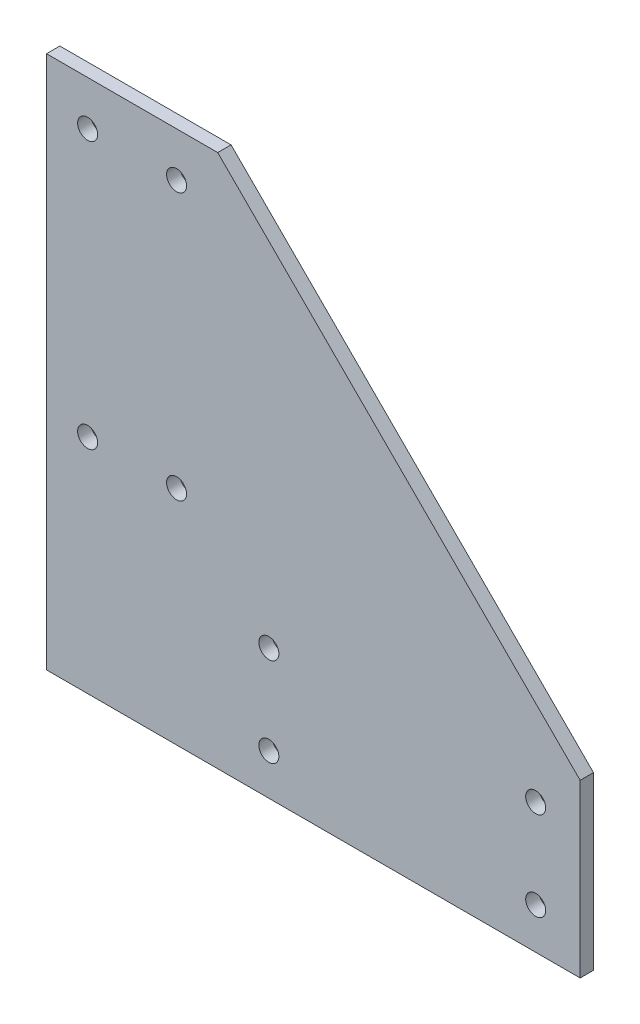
ISO-10303-21;
HEADER;
FILE_DESCRIPTION(('STEP AP214'),'2;1');
FILE_NAME('part.step','',(''),(''),'','','');
FILE_SCHEMA(('AUTOMOTIVE_DESIGN { 1 0 10303 214 1 1 1 1 }'));
ENDSEC;
DATA;
#1=APPLICATION_CONTEXT('core data for automotive mechanical design processes');
#2=APPLICATION_PROTOCOL_DEFINITION('international standard','automotive_design',2000,#1);
#3=PRODUCT_CONTEXT('',#1,'mechanical');
#4=PRODUCT('Part','Part','',(#3));
#5=PRODUCT_RELATED_PRODUCT_CATEGORY('part','',(#4));
#6=PRODUCT_DEFINITION_FORMATION('','',#4);
#7=PRODUCT_DEFINITION_CONTEXT('part definition',#1,'design');
#8=PRODUCT_DEFINITION('design','',#6,#7);
#9=PRODUCT_DEFINITION_SHAPE('','',#8);
#10=(LENGTH_UNIT() NAMED_UNIT(*) SI_UNIT(.MILLI.,.METRE.));
#11=(NAMED_UNIT(*) PLANE_ANGLE_UNIT() SI_UNIT($,.RADIAN.));
#12=(NAMED_UNIT(*) SI_UNIT($,.STERADIAN.) SOLID_ANGLE_UNIT());
#13=UNCERTAINTY_MEASURE_WITH_UNIT(LENGTH_MEASURE(1.E-05),#10,'distance_accuracy_value','');
#14=(GEOMETRIC_REPRESENTATION_CONTEXT(3) GLOBAL_UNCERTAINTY_ASSIGNED_CONTEXT((#13)) GLOBAL_UNIT_ASSIGNED_CONTEXT((#10,
#11,#12)) REPRESENTATION_CONTEXT('',''));
#15=CARTESIAN_POINT('',(0.,0.,0.));
#16=DIRECTION('',(0.,0.,1.));
#17=DIRECTION('',(1.,0.,0.));
#18=AXIS2_PLACEMENT_3D('',#15,#16,#17);
#19=CARTESIAN_POINT('',(-120.,120.,6.));
#20=DIRECTION('',(1.,0.,0.));
#21=DIRECTION('',(0.,0.,-1.));
#22=AXIS2_PLACEMENT_3D('',#19,#20,#21);
#23=PLANE('',#22);
#24=DIRECTION('',(0.,-1.,0.));
#25=VECTOR('',#24,1.);
#26=CARTESIAN_POINT('',(-120.,120.,0.));
#27=LINE('',#26,#25);
#28=CARTESIAN_POINT('',(-120.,120.,0.));
#29=VERTEX_POINT('',#28);
#30=CARTESIAN_POINT('',(-120.,-120.,0.));
#31=VERTEX_POINT('',#30);
#32=EDGE_CURVE('E107',#29,#31,#27,.T.);
#33=ORIENTED_EDGE('',*,*,#32,.T.);
#34=DIRECTION('',(0.,0.,-1.));
#35=VECTOR('',#34,1.);
#36=CARTESIAN_POINT('',(-120.,-120.,6.));
#37=LINE('',#36,#35);
#38=CARTESIAN_POINT('',(-120.,-120.,6.));
#39=VERTEX_POINT('',#38);
#40=EDGE_CURVE('E11',#39,#31,#37,.T.);
#41=ORIENTED_EDGE('',*,*,#40,.F.);
#42=DIRECTION('',(0.,-1.,0.));
#43=VECTOR('',#42,1.);
#44=CARTESIAN_POINT('',(-120.,120.,6.));
#45=LINE('',#44,#43);
#46=CARTESIAN_POINT('',(-120.,120.,6.));
#47=VERTEX_POINT('',#46);
#48=EDGE_CURVE('E116',#47,#39,#45,.T.);
#49=ORIENTED_EDGE('',*,*,#48,.F.);
#50=DIRECTION('',(0.,0.,-1.));
#51=VECTOR('',#50,1.);
#52=CARTESIAN_POINT('',(-120.,120.,6.));
#53=LINE('',#52,#51);
#54=EDGE_CURVE('E103',#47,#29,#53,.T.);
#55=ORIENTED_EDGE('',*,*,#54,.T.);
#56=EDGE_LOOP('',(#33,#41,#49,#55));
#57=FACE_BOUND('',#56,.T.);
#58=ADVANCED_FACE('F31',(#57),#23,.F.);
#59=CARTESIAN_POINT('',(-120.,-120.,6.));
#60=DIRECTION('',(0.,1.,0.));
#61=DIRECTION('',(0.,0.,1.));
#62=AXIS2_PLACEMENT_3D('',#59,#60,#61);
#63=PLANE('',#62);
#64=DIRECTION('',(1.,0.,0.));
#65=VECTOR('',#64,1.);
#66=CARTESIAN_POINT('',(-120.,-120.,0.));
#67=LINE('',#66,#65);
#68=CARTESIAN_POINT('',(120.,-120.,0.));
#69=VERTEX_POINT('',#68);
#70=EDGE_CURVE('E110',#31,#69,#67,.T.);
#71=ORIENTED_EDGE('',*,*,#70,.T.);
#72=DIRECTION('',(0.,0.,-1.));
#73=VECTOR('',#72,1.);
#74=CARTESIAN_POINT('',(120.,-120.,6.));
#75=LINE('',#74,#73);
#76=CARTESIAN_POINT('',(120.,-120.,6.));
#77=VERTEX_POINT('',#76);
#78=EDGE_CURVE('E40',#77,#69,#75,.T.);
#79=ORIENTED_EDGE('',*,*,#78,.F.);
#80=DIRECTION('',(1.,0.,0.));
#81=VECTOR('',#80,1.);
#82=CARTESIAN_POINT('',(-120.,-120.,6.));
#83=LINE('',#82,#81);
#84=EDGE_CURVE('E83',#39,#77,#83,.T.);
#85=ORIENTED_EDGE('',*,*,#84,.F.);
#86=ORIENTED_EDGE('',*,*,#40,.T.);
#87=EDGE_LOOP('',(#71,#79,#85,#86));
#88=FACE_BOUND('',#87,.T.);
#89=ADVANCED_FACE('F171',(#88),#63,.F.);
#90=CARTESIAN_POINT('',(120.,-43.,6.));
#91=DIRECTION('',(-1.,0.,0.));
#92=DIRECTION('',(0.,-1.,0.));
#93=AXIS2_PLACEMENT_3D('',#90,#91,#92);
#94=PLANE('',#93);
#95=DIRECTION('',(0.,1.,0.));
#96=VECTOR('',#95,1.);
#97=CARTESIAN_POINT('',(120.,-43.,0.));
#98=LINE('',#97,#96);
#99=CARTESIAN_POINT('',(120.,-43.,0.));
#100=VERTEX_POINT('',#99);
#101=EDGE_CURVE('E98',#69,#100,#98,.T.);
#102=ORIENTED_EDGE('',*,*,#101,.T.);
#103=DIRECTION('',(0.,0.,-1.));
#104=VECTOR('',#103,1.);
#105=CARTESIAN_POINT('',(120.,-43.,6.));
#106=LINE('',#105,#104);
#107=CARTESIAN_POINT('',(120.,-43.,6.));
#108=VERTEX_POINT('',#107);
#109=EDGE_CURVE('E95',#108,#100,#106,.T.);
#110=ORIENTED_EDGE('',*,*,#109,.F.);
#111=DIRECTION('',(0.,1.,0.));
#112=VECTOR('',#111,1.);
#113=CARTESIAN_POINT('',(120.,-43.,6.));
#114=LINE('',#113,#112);
#115=EDGE_CURVE('E87',#77,#108,#114,.T.);
#116=ORIENTED_EDGE('',*,*,#115,.F.);
#117=ORIENTED_EDGE('',*,*,#78,.T.);
#118=EDGE_LOOP('',(#102,#110,#116,#117));
#119=FACE_BOUND('',#118,.T.);
#120=ADVANCED_FACE('F96',(#119),#94,.F.);
#121=CARTESIAN_POINT('',(-43.,120.,6.));
#122=DIRECTION('',(-0.707106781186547,-0.707106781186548,0.));
#123=DIRECTION('',(0.707106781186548,-0.707106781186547,0.));
#124=AXIS2_PLACEMENT_3D('',#121,#122,#123);
#125=PLANE('',#124);
#126=DIRECTION('',(-0.707106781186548,0.707106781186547,0.));
#127=VECTOR('',#126,1.);
#128=CARTESIAN_POINT('',(-43.,120.,0.));
#129=LINE('',#128,#127);
#130=CARTESIAN_POINT('',(-43.,120.,0.));
#131=VERTEX_POINT('',#130);
#132=EDGE_CURVE('E69',#100,#131,#129,.T.);
#133=ORIENTED_EDGE('',*,*,#132,.T.);
#134=DIRECTION('',(0.,0.,-1.));
#135=VECTOR('',#134,1.);
#136=CARTESIAN_POINT('',(-43.,120.,6.));
#137=LINE('',#136,#135);
#138=CARTESIAN_POINT('',(-43.,120.,6.));
#139=VERTEX_POINT('',#138);
#140=EDGE_CURVE('E99',#139,#131,#137,.T.);
#141=ORIENTED_EDGE('',*,*,#140,.F.);
#142=DIRECTION('',(-0.707106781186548,0.707106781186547,0.));
#143=VECTOR('',#142,1.);
#144=CARTESIAN_POINT('',(-43.,120.,6.));
#145=LINE('',#144,#143);
#146=EDGE_CURVE('E91',#108,#139,#145,.T.);
#147=ORIENTED_EDGE('',*,*,#146,.F.);
#148=ORIENTED_EDGE('',*,*,#109,.T.);
#149=EDGE_LOOP('',(#133,#141,#147,#148));
#150=FACE_BOUND('',#149,.T.);
#151=ADVANCED_FACE('F101',(#150),#125,.F.);
#152=CARTESIAN_POINT('',(-120.,120.,6.));
#153=DIRECTION('',(0.,-1.,0.));
#154=DIRECTION('',(0.,0.,-1.));
#155=AXIS2_PLACEMENT_3D('',#152,#153,#154);
#156=PLANE('',#155);
#157=DIRECTION('',(-1.,0.,0.));
#158=VECTOR('',#157,1.);
#159=CARTESIAN_POINT('',(-120.,120.,0.));
#160=LINE('',#159,#158);
#161=EDGE_CURVE('E75',#131,#29,#160,.T.);
#162=ORIENTED_EDGE('',*,*,#161,.T.);
#163=ORIENTED_EDGE('',*,*,#54,.F.);
#164=DIRECTION('',(-1.,0.,0.));
#165=VECTOR('',#164,1.);
#166=CARTESIAN_POINT('',(-120.,120.,6.));
#167=LINE('',#166,#165);
#168=EDGE_CURVE('E49',#139,#47,#167,.T.);
#169=ORIENTED_EDGE('',*,*,#168,.F.);
#170=ORIENTED_EDGE('',*,*,#140,.T.);
#171=EDGE_LOOP('',(#162,#163,#169,#170));
#172=FACE_BOUND('',#171,.T.);
#173=ADVANCED_FACE('F185',(#172),#156,.F.);
#174=CARTESIAN_POINT('',(-120.,-120.,6.));
#175=DIRECTION('',(0.,0.,1.));
#176=DIRECTION('',(1.,0.,0.));
#177=AXIS2_PLACEMENT_3D('',#174,#175,#176);
#178=PLANE('',#177);
#179=CARTESIAN_POINT('',(-20.,-101.5,6.));
#180=DIRECTION('',(0.,0.,1.));
#181=DIRECTION('',(1.,0.,0.));
#182=AXIS2_PLACEMENT_3D('',#179,#180,#181);
#183=CIRCLE('',#182,4.49999999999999);
#184=CARTESIAN_POINT('',(-15.5,-101.5,6.));
#185=VERTEX_POINT('',#184);
#186=EDGE_CURVE('E154',#185,#185,#183,.T.);
#187=ORIENTED_EDGE('',*,*,#186,.F.);
#188=EDGE_LOOP('',(#187));
#189=FACE_BOUND('',#188,.T.);
#190=CARTESIAN_POINT('',(-20.,-61.5,6.));
#191=DIRECTION('',(0.,0.,1.));
#192=DIRECTION('',(1.,0.,0.));
#193=AXIS2_PLACEMENT_3D('',#190,#191,#192);
#194=CIRCLE('',#193,4.49999999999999);
#195=CARTESIAN_POINT('',(-15.5,-61.5,6.));
#196=VERTEX_POINT('',#195);
#197=EDGE_CURVE('E144',#196,#196,#194,.T.);
#198=ORIENTED_EDGE('',*,*,#197,.F.);
#199=EDGE_LOOP('',(#198));
#200=FACE_BOUND('',#199,.T.);
#201=CARTESIAN_POINT('',(100.,-101.5,6.));
#202=DIRECTION('',(0.,0.,1.));
#203=DIRECTION('',(1.,0.,0.));
#204=AXIS2_PLACEMENT_3D('',#201,#202,#203);
#205=CIRCLE('',#204,4.49999999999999);
#206=CARTESIAN_POINT('',(104.5,-101.5,6.));
#207=VERTEX_POINT('',#206);
#208=EDGE_CURVE('E141',#207,#207,#205,.T.);
#209=ORIENTED_EDGE('',*,*,#208,.F.);
#210=EDGE_LOOP('',(#209));
#211=FACE_BOUND('',#210,.T.);
#212=CARTESIAN_POINT('',(100.,-61.5,6.));
#213=DIRECTION('',(0.,0.,1.));
#214=DIRECTION('',(1.,0.,0.));
#215=AXIS2_PLACEMENT_3D('',#212,#213,#214);
#216=CIRCLE('',#215,4.49999999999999);
#217=CARTESIAN_POINT('',(104.5,-61.5,6.));
#218=VERTEX_POINT('',#217);
#219=EDGE_CURVE('E138',#218,#218,#216,.T.);
#220=ORIENTED_EDGE('',*,*,#219,.F.);
#221=EDGE_LOOP('',(#220));
#222=FACE_BOUND('',#221,.T.);
#223=CARTESIAN_POINT('',(-101.5,-20.,6.));
#224=DIRECTION('',(0.,0.,1.));
#225=DIRECTION('',(1.,0.,0.));
#226=AXIS2_PLACEMENT_3D('',#223,#224,#225);
#227=CIRCLE('',#226,4.49999999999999);
#228=CARTESIAN_POINT('',(-97.,-20.,6.));
#229=VERTEX_POINT('',#228);
#230=EDGE_CURVE('E134',#229,#229,#227,.T.);
#231=ORIENTED_EDGE('',*,*,#230,.F.);
#232=EDGE_LOOP('',(#231));
#233=FACE_BOUND('',#232,.T.);
#234=CARTESIAN_POINT('',(-61.5,-20.,6.));
#235=DIRECTION('',(0.,0.,1.));
#236=DIRECTION('',(1.,0.,0.));
#237=AXIS2_PLACEMENT_3D('',#234,#235,#236);
#238=CIRCLE('',#237,4.49999999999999);
#239=CARTESIAN_POINT('',(-57.,-20.,6.));
#240=VERTEX_POINT('',#239);
#241=EDGE_CURVE('E130',#240,#240,#238,.T.);
#242=ORIENTED_EDGE('',*,*,#241,.F.);
#243=EDGE_LOOP('',(#242));
#244=FACE_BOUND('',#243,.T.);
#245=CARTESIAN_POINT('',(-101.5,100.,6.));
#246=DIRECTION('',(0.,0.,1.));
#247=DIRECTION('',(1.,0.,0.));
#248=AXIS2_PLACEMENT_3D('',#245,#246,#247);
#249=CIRCLE('',#248,4.49999999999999);
#250=CARTESIAN_POINT('',(-97.,100.,6.));
#251=VERTEX_POINT('',#250);
#252=EDGE_CURVE('E126',#251,#251,#249,.T.);
#253=ORIENTED_EDGE('',*,*,#252,.F.);
#254=EDGE_LOOP('',(#253));
#255=FACE_BOUND('',#254,.T.);
#256=CARTESIAN_POINT('',(-61.5,100.,6.));
#257=DIRECTION('',(0.,0.,1.));
#258=DIRECTION('',(1.,0.,0.));
#259=AXIS2_PLACEMENT_3D('',#256,#257,#258);
#260=CIRCLE('',#259,4.49999999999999);
#261=CARTESIAN_POINT('',(-57.,100.,6.));
#262=VERTEX_POINT('',#261);
#263=EDGE_CURVE('E122',#262,#262,#260,.T.);
#264=ORIENTED_EDGE('',*,*,#263,.F.);
#265=EDGE_LOOP('',(#264));
#266=FACE_BOUND('',#265,.T.);
#267=ORIENTED_EDGE('',*,*,#48,.T.);
#268=ORIENTED_EDGE('',*,*,#84,.T.);
#269=ORIENTED_EDGE('',*,*,#115,.T.);
#270=ORIENTED_EDGE('',*,*,#146,.T.);
#271=ORIENTED_EDGE('',*,*,#168,.T.);
#272=EDGE_LOOP('',(#267,#268,#269,#270,#271));
#273=FACE_BOUND('',#272,.T.);
#274=ADVANCED_FACE('F89',(#189,#200,#211,#222,#233,#244,#255,#266,#273),#178,.T.);
#275=CARTESIAN_POINT('',(-120.,-120.,0.));
#276=DIRECTION('',(0.,0.,1.));
#277=DIRECTION('',(1.,0.,0.));
#278=AXIS2_PLACEMENT_3D('',#275,#276,#277);
#279=PLANE('',#278);
#280=CARTESIAN_POINT('',(-20.,-101.5,0.));
#281=DIRECTION('',(0.,0.,1.));
#282=DIRECTION('',(1.,0.,0.));
#283=AXIS2_PLACEMENT_3D('',#280,#281,#282);
#284=CIRCLE('',#283,4.49999999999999);
#285=CARTESIAN_POINT('',(-15.5,-101.5,0.));
#286=VERTEX_POINT('',#285);
#287=EDGE_CURVE('E34',#286,#286,#284,.T.);
#288=ORIENTED_EDGE('',*,*,#287,.T.);
#289=EDGE_LOOP('',(#288));
#290=FACE_BOUND('',#289,.T.);
#291=CARTESIAN_POINT('',(-20.,-61.5,0.));
#292=DIRECTION('',(0.,0.,1.));
#293=DIRECTION('',(1.,0.,0.));
#294=AXIS2_PLACEMENT_3D('',#291,#292,#293);
#295=CIRCLE('',#294,4.49999999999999);
#296=CARTESIAN_POINT('',(-15.5,-61.5,0.));
#297=VERTEX_POINT('',#296);
#298=EDGE_CURVE('E142',#297,#297,#295,.T.);
#299=ORIENTED_EDGE('',*,*,#298,.T.);
#300=EDGE_LOOP('',(#299));
#301=FACE_BOUND('',#300,.T.);
#302=CARTESIAN_POINT('',(100.,-101.5,0.));
#303=DIRECTION('',(0.,0.,1.));
#304=DIRECTION('',(1.,0.,0.));
#305=AXIS2_PLACEMENT_3D('',#302,#303,#304);
#306=CIRCLE('',#305,4.49999999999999);
#307=CARTESIAN_POINT('',(104.5,-101.5,0.));
#308=VERTEX_POINT('',#307);
#309=EDGE_CURVE('E139',#308,#308,#306,.T.);
#310=ORIENTED_EDGE('',*,*,#309,.T.);
#311=EDGE_LOOP('',(#310));
#312=FACE_BOUND('',#311,.T.);
#313=CARTESIAN_POINT('',(100.,-61.5,0.));
#314=DIRECTION('',(0.,0.,1.));
#315=DIRECTION('',(1.,0.,0.));
#316=AXIS2_PLACEMENT_3D('',#313,#314,#315);
#317=CIRCLE('',#316,4.49999999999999);
#318=CARTESIAN_POINT('',(104.5,-61.5,0.));
#319=VERTEX_POINT('',#318);
#320=EDGE_CURVE('E135',#319,#319,#317,.T.);
#321=ORIENTED_EDGE('',*,*,#320,.T.);
#322=EDGE_LOOP('',(#321));
#323=FACE_BOUND('',#322,.T.);
#324=CARTESIAN_POINT('',(-101.5,-20.,0.));
#325=DIRECTION('',(0.,0.,1.));
#326=DIRECTION('',(1.,0.,0.));
#327=AXIS2_PLACEMENT_3D('',#324,#325,#326);
#328=CIRCLE('',#327,4.49999999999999);
#329=CARTESIAN_POINT('',(-97.,-20.,0.));
#330=VERTEX_POINT('',#329);
#331=EDGE_CURVE('E131',#330,#330,#328,.T.);
#332=ORIENTED_EDGE('',*,*,#331,.T.);
#333=EDGE_LOOP('',(#332));
#334=FACE_BOUND('',#333,.T.);
#335=CARTESIAN_POINT('',(-61.5,-20.,0.));
#336=DIRECTION('',(0.,0.,1.));
#337=DIRECTION('',(1.,0.,0.));
#338=AXIS2_PLACEMENT_3D('',#335,#336,#337);
#339=CIRCLE('',#338,4.49999999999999);
#340=CARTESIAN_POINT('',(-57.,-20.,0.));
#341=VERTEX_POINT('',#340);
#342=EDGE_CURVE('E127',#341,#341,#339,.T.);
#343=ORIENTED_EDGE('',*,*,#342,.T.);
#344=EDGE_LOOP('',(#343));
#345=FACE_BOUND('',#344,.T.);
#346=CARTESIAN_POINT('',(-101.5,100.,0.));
#347=DIRECTION('',(0.,0.,1.));
#348=DIRECTION('',(1.,0.,0.));
#349=AXIS2_PLACEMENT_3D('',#346,#347,#348);
#350=CIRCLE('',#349,4.49999999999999);
#351=CARTESIAN_POINT('',(-97.,100.,0.));
#352=VERTEX_POINT('',#351);
#353=EDGE_CURVE('E123',#352,#352,#350,.T.);
#354=ORIENTED_EDGE('',*,*,#353,.T.);
#355=EDGE_LOOP('',(#354));
#356=FACE_BOUND('',#355,.T.);
#357=CARTESIAN_POINT('',(-61.5,100.,0.));
#358=DIRECTION('',(0.,0.,1.));
#359=DIRECTION('',(1.,0.,0.));
#360=AXIS2_PLACEMENT_3D('',#357,#358,#359);
#361=CIRCLE('',#360,4.49999999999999);
#362=CARTESIAN_POINT('',(-57.,100.,0.));
#363=VERTEX_POINT('',#362);
#364=EDGE_CURVE('E111',#363,#363,#361,.T.);
#365=ORIENTED_EDGE('',*,*,#364,.T.);
#366=EDGE_LOOP('',(#365));
#367=FACE_BOUND('',#366,.T.);
#368=ORIENTED_EDGE('',*,*,#32,.F.);
#369=ORIENTED_EDGE('',*,*,#161,.F.);
#370=ORIENTED_EDGE('',*,*,#132,.F.);
#371=ORIENTED_EDGE('',*,*,#101,.F.);
#372=ORIENTED_EDGE('',*,*,#70,.F.);
#373=EDGE_LOOP('',(#368,#369,#370,#371,#372));
#374=FACE_BOUND('',#373,.T.);
#375=ADVANCED_FACE('F173',(#290,#301,#312,#323,#334,#345,#356,#367,#374),#279,.F.);
#376=CARTESIAN_POINT('',(-61.5,100.,6.));
#377=DIRECTION('',(0.,0.,1.));
#378=DIRECTION('',(1.,0.,0.));
#379=AXIS2_PLACEMENT_3D('',#376,#377,#378);
#380=CYLINDRICAL_SURFACE('',#379,4.49999999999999);
#381=ORIENTED_EDGE('',*,*,#263,.T.);
#382=EDGE_LOOP('',(#381));
#383=FACE_BOUND('',#382,.T.);
#384=ORIENTED_EDGE('',*,*,#364,.F.);
#385=EDGE_LOOP('',(#384));
#386=FACE_BOUND('',#385,.T.);
#387=ADVANCED_FACE('F175',(#383,#386),#380,.F.);
#388=CARTESIAN_POINT('',(-101.5,100.,6.));
#389=DIRECTION('',(0.,0.,1.));
#390=DIRECTION('',(1.,0.,0.));
#391=AXIS2_PLACEMENT_3D('',#388,#389,#390);
#392=CYLINDRICAL_SURFACE('',#391,4.49999999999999);
#393=ORIENTED_EDGE('',*,*,#252,.T.);
#394=EDGE_LOOP('',(#393));
#395=FACE_BOUND('',#394,.T.);
#396=ORIENTED_EDGE('',*,*,#353,.F.);
#397=EDGE_LOOP('',(#396));
#398=FACE_BOUND('',#397,.T.);
#399=ADVANCED_FACE('F182',(#395,#398),#392,.F.);
#400=CARTESIAN_POINT('',(-61.5,-20.,6.));
#401=DIRECTION('',(0.,0.,1.));
#402=DIRECTION('',(1.,0.,0.));
#403=AXIS2_PLACEMENT_3D('',#400,#401,#402);
#404=CYLINDRICAL_SURFACE('',#403,4.49999999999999);
#405=ORIENTED_EDGE('',*,*,#241,.T.);
#406=EDGE_LOOP('',(#405));
#407=FACE_BOUND('',#406,.T.);
#408=ORIENTED_EDGE('',*,*,#342,.F.);
#409=EDGE_LOOP('',(#408));
#410=FACE_BOUND('',#409,.T.);
#411=ADVANCED_FACE('F267',(#407,#410),#404,.F.);
#412=CARTESIAN_POINT('',(-101.5,-20.,6.));
#413=DIRECTION('',(0.,0.,1.));
#414=DIRECTION('',(1.,0.,0.));
#415=AXIS2_PLACEMENT_3D('',#412,#413,#414);
#416=CYLINDRICAL_SURFACE('',#415,4.49999999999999);
#417=ORIENTED_EDGE('',*,*,#230,.T.);
#418=EDGE_LOOP('',(#417));
#419=FACE_BOUND('',#418,.T.);
#420=ORIENTED_EDGE('',*,*,#331,.F.);
#421=EDGE_LOOP('',(#420));
#422=FACE_BOUND('',#421,.T.);
#423=ADVANCED_FACE('F215',(#419,#422),#416,.F.);
#424=CARTESIAN_POINT('',(100.,-61.5,6.));
#425=DIRECTION('',(0.,0.,1.));
#426=DIRECTION('',(1.,0.,0.));
#427=AXIS2_PLACEMENT_3D('',#424,#425,#426);
#428=CYLINDRICAL_SURFACE('',#427,4.49999999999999);
#429=ORIENTED_EDGE('',*,*,#219,.T.);
#430=EDGE_LOOP('',(#429));
#431=FACE_BOUND('',#430,.T.);
#432=ORIENTED_EDGE('',*,*,#320,.F.);
#433=EDGE_LOOP('',(#432));
#434=FACE_BOUND('',#433,.T.);
#435=ADVANCED_FACE('F225',(#431,#434),#428,.F.);
#436=CARTESIAN_POINT('',(100.,-101.5,6.));
#437=DIRECTION('',(0.,0.,1.));
#438=DIRECTION('',(1.,0.,0.));
#439=AXIS2_PLACEMENT_3D('',#436,#437,#438);
#440=CYLINDRICAL_SURFACE('',#439,4.49999999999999);
#441=ORIENTED_EDGE('',*,*,#208,.T.);
#442=EDGE_LOOP('',(#441));
#443=FACE_BOUND('',#442,.T.);
#444=ORIENTED_EDGE('',*,*,#309,.F.);
#445=EDGE_LOOP('',(#444));
#446=FACE_BOUND('',#445,.T.);
#447=ADVANCED_FACE('F230',(#443,#446),#440,.F.);
#448=CARTESIAN_POINT('',(-20.,-61.5,6.));
#449=DIRECTION('',(0.,0.,1.));
#450=DIRECTION('',(1.,0.,0.));
#451=AXIS2_PLACEMENT_3D('',#448,#449,#450);
#452=CYLINDRICAL_SURFACE('',#451,4.49999999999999);
#453=ORIENTED_EDGE('',*,*,#197,.T.);
#454=EDGE_LOOP('',(#453));
#455=FACE_BOUND('',#454,.T.);
#456=ORIENTED_EDGE('',*,*,#298,.F.);
#457=EDGE_LOOP('',(#456));
#458=FACE_BOUND('',#457,.T.);
#459=ADVANCED_FACE('F240',(#455,#458),#452,.F.);
#460=CARTESIAN_POINT('',(-20.,-101.5,6.));
#461=DIRECTION('',(0.,0.,1.));
#462=DIRECTION('',(1.,0.,0.));
#463=AXIS2_PLACEMENT_3D('',#460,#461,#462);
#464=CYLINDRICAL_SURFACE('',#463,4.49999999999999);
#465=ORIENTED_EDGE('',*,*,#186,.T.);
#466=EDGE_LOOP('',(#465));
#467=FACE_BOUND('',#466,.T.);
#468=ORIENTED_EDGE('',*,*,#287,.F.);
#469=EDGE_LOOP('',(#468));
#470=FACE_BOUND('',#469,.T.);
#471=ADVANCED_FACE('F250',(#467,#470),#464,.F.);
#472=CLOSED_SHELL('',(#58,#89,#120,#151,#173,#274,#375,#387,#399,#411,#423,#435,#447,#459,#471));
#473=MANIFOLD_SOLID_BREP('B2',#472);
#474=ADVANCED_BREP_SHAPE_REPRESENTATION('',(#18,#473),#14);
#475=SHAPE_DEFINITION_REPRESENTATION(#9,#474);
ENDSEC;
END-ISO-10303-21;
